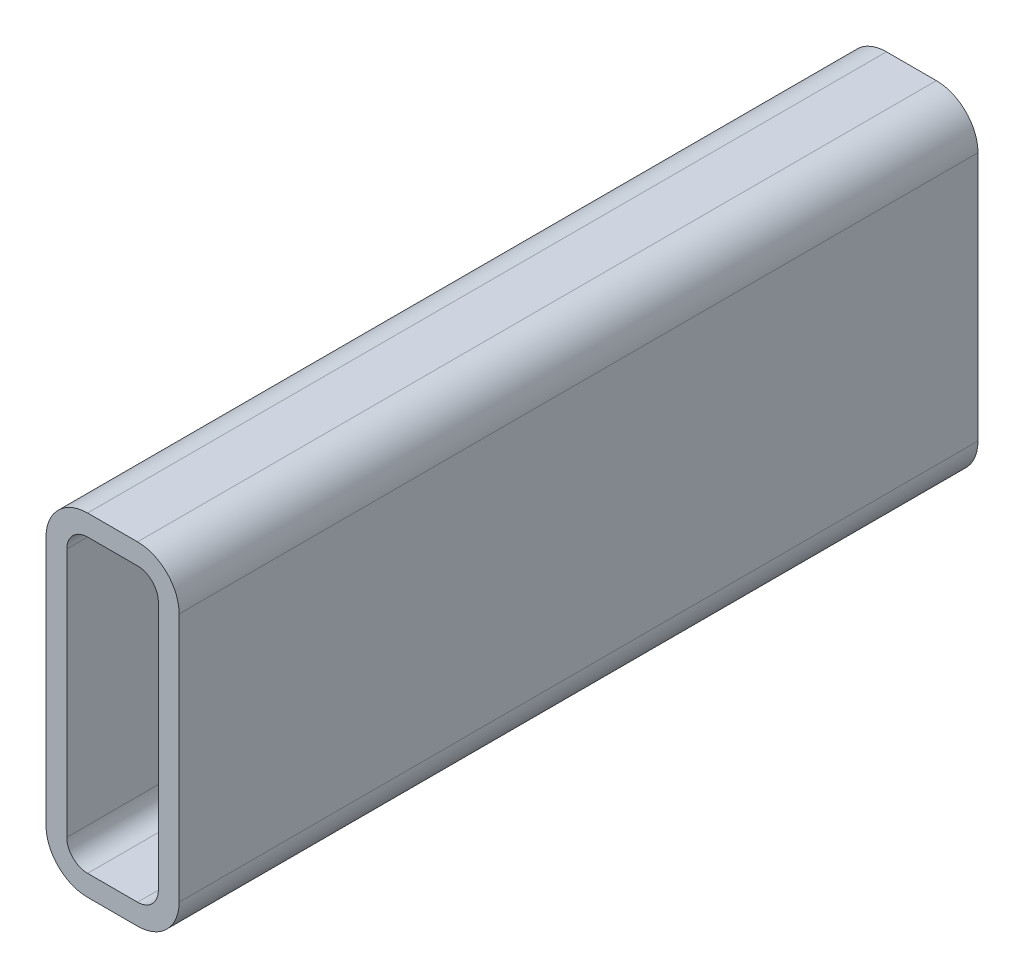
from build123d import *

# Parameters (mm, degrees)
BOSS_EXTRUDE1_DEPTH = 304.8


with BuildPart() as part:
    # Sketch1 → Boss-Extrude1 (new body)
    with BuildSketch(Plane.XY):
        with BuildLine():
            Line((15.875, 127), (34.925, 127))
            ThreePointArc((34.925, 127), (46.150320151, 122.350320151), (50.8, 111.125))
            Line((50.8, 111.125), (50.8, 15.875))
            ThreePointArc((50.8, 15.875), (46.150320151, 4.649679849), (34.925, 0))
            Line((34.925, 0), (15.875, 0))
            ThreePointArc((15.875, 0), (4.649679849, 4.649679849), (0, 15.875))
            Line((0, 15.875), (0, 111.125))
            ThreePointArc((0, 111.125), (4.649679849, 122.350320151), (15.875, 127))
        make_face()
        with BuildLine():
            Line((15.875, 119.0625), (34.925, 119.0625))
            ThreePointArc((34.925, 119.0625), (40.537660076, 116.737660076), (42.8625, 111.125))
            Line((42.8625, 111.125), (42.8625, 15.875))
            ThreePointArc((42.8625, 15.875), (40.537660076, 10.262339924), (34.925, 7.9375))
            Line((34.925, 7.9375), (15.875, 7.9375))
            ThreePointArc((15.875, 7.9375), (10.262339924, 10.262339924), (7.9375, 15.875))
            Line((7.9375, 15.875), (7.9375, 111.125))
            ThreePointArc((7.9375, 111.125), (10.262339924, 116.737660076), (15.875, 119.0625))
        make_face(mode=Mode.SUBTRACT)
    extrude(amount=BOSS_EXTRUDE1_DEPTH)


solid = part.part
